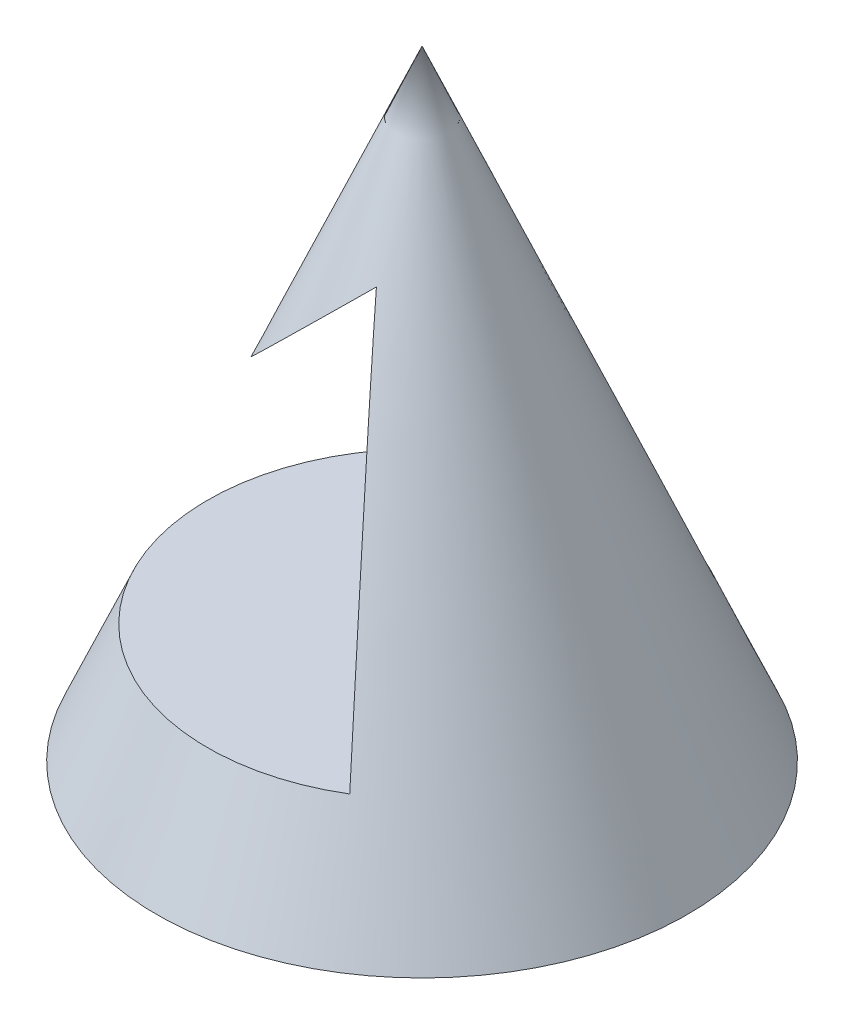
ISO-10303-21;
HEADER;
FILE_DESCRIPTION(('STEP AP214'),'2;1');
FILE_NAME('part.step','',(''),(''),'','','');
FILE_SCHEMA(('AUTOMOTIVE_DESIGN { 1 0 10303 214 1 1 1 1 }'));
ENDSEC;
DATA;
#1=APPLICATION_CONTEXT('core data for automotive mechanical design processes');
#2=APPLICATION_PROTOCOL_DEFINITION('international standard','automotive_design',2000,#1);
#3=PRODUCT_CONTEXT('',#1,'mechanical');
#4=PRODUCT('Part','Part','',(#3));
#5=PRODUCT_RELATED_PRODUCT_CATEGORY('part','',(#4));
#6=PRODUCT_DEFINITION_FORMATION('','',#4);
#7=PRODUCT_DEFINITION_CONTEXT('part definition',#1,'design');
#8=PRODUCT_DEFINITION('design','',#6,#7);
#9=PRODUCT_DEFINITION_SHAPE('','',#8);
#10=(LENGTH_UNIT() NAMED_UNIT(*) SI_UNIT(.MILLI.,.METRE.));
#11=(NAMED_UNIT(*) PLANE_ANGLE_UNIT() SI_UNIT($,.RADIAN.));
#12=(NAMED_UNIT(*) SI_UNIT($,.STERADIAN.) SOLID_ANGLE_UNIT());
#13=UNCERTAINTY_MEASURE_WITH_UNIT(LENGTH_MEASURE(1.E-05),#10,'distance_accuracy_value','');
#14=(GEOMETRIC_REPRESENTATION_CONTEXT(3) GLOBAL_UNCERTAINTY_ASSIGNED_CONTEXT((#13)) GLOBAL_UNIT_ASSIGNED_CONTEXT((#10,
#11,#12)) REPRESENTATION_CONTEXT('',''));
#15=CARTESIAN_POINT('',(0.,0.,0.));
#16=DIRECTION('',(0.,0.,1.));
#17=DIRECTION('',(1.,0.,0.));
#18=AXIS2_PLACEMENT_3D('',#15,#16,#17);
#19=CARTESIAN_POINT('',(0.,0.,0.));
#20=DIRECTION('',(0.,-1.,0.));
#21=DIRECTION('',(0.,0.,-1.));
#22=AXIS2_PLACEMENT_3D('',#19,#20,#21);
#23=PLANE('',#22);
#24=CARTESIAN_POINT('',(0.,0.,0.));
#25=DIRECTION('',(0.,-1.,0.));
#26=DIRECTION('',(0.,0.,-1.));
#27=AXIS2_PLACEMENT_3D('',#24,#25,#26);
#28=CIRCLE('',#27,30.);
#29=CARTESIAN_POINT('',(0.,0.,-30.));
#30=VERTEX_POINT('',#29);
#31=EDGE_CURVE('E76',#30,#30,#28,.T.);
#32=ORIENTED_EDGE('',*,*,#31,.T.);
#33=EDGE_LOOP('',(#32));
#34=FACE_BOUND('',#33,.T.);
#35=ADVANCED_FACE('F43',(#34),#23,.T.);
#36=CARTESIAN_POINT('',(0.,0.,0.));
#37=DIRECTION('',(0.,-1.,0.));
#38=DIRECTION('',(0.,0.,-1.));
#39=AXIS2_PLACEMENT_3D('',#36,#37,#38);
#40=CONICAL_SURFACE('',#39,30.,0.404891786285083);
#41=CARTESIAN_POINT('',(-4.5966851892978,44.5253184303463,0.));
#42=DIRECTION('',(-0.700802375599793,0.713355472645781,0.));
#43=DIRECTION('',(-0.713355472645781,-0.700802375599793,0.));
#44=AXIS2_PLACEMENT_3D('',#41,#42,#43);
#45=ELLIPSE('',#44,15.3047408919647,9.9028839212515);
#46=CARTESIAN_POINT('',(2.42403092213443,51.4224892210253,7.58381034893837));
#47=VERTEX_POINT('',#46);
#48=CARTESIAN_POINT('',(2.42403092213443,51.4224892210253,-7.58381034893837));
#49=VERTEX_POINT('',#48);
#50=EDGE_CURVE('E11',#47,#49,#45,.F.);
#51=ORIENTED_EDGE('',*,*,#50,.F.);
#52=CARTESIAN_POINT('',(12.557979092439,13.4407902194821,20.7330254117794));
#53=CARTESIAN_POINT('',(12.2029958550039,14.7712555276,20.2813906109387));
#54=CARTESIAN_POINT('',(11.8480380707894,16.1016254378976,19.8294544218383));
#55=CARTESIAN_POINT('',(11.1381883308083,18.762118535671,18.924802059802));
#56=CARTESIAN_POINT('',(10.7832963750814,20.0922417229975,18.4720858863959));
#57=CARTESIAN_POINT('',(10.0735856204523,22.752213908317,17.5656866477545));
#58=CARTESIAN_POINT('',(9.71876682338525,24.0820628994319,17.1120035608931));
#59=CARTESIAN_POINT('',(9.00923241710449,26.7413741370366,16.2034260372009));
#60=CARTESIAN_POINT('',(8.65451680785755,28.0708363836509,15.7485316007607));
#61=CARTESIAN_POINT('',(7.94524469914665,30.7291645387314,14.8372149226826));
#62=CARTESIAN_POINT('',(7.59068818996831,32.0580304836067,14.3807927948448));
#63=CARTESIAN_POINT('',(6.88175187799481,34.7151000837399,13.4658884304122));
#64=CARTESIAN_POINT('',(6.52737207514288,36.0433037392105,13.0074061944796));
#65=CARTESIAN_POINT('',(5.81885748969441,38.6987927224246,12.0876400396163));
#66=CARTESIAN_POINT('',(5.46472270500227,40.0260780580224,11.6263561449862));
#67=CARTESIAN_POINT('',(4.75679622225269,42.6793628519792,10.6998458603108));
#68=CARTESIAN_POINT('',(4.40300452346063,44.0053623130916,10.2346194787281));
#69=CARTESIAN_POINT('',(3.91381522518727,45.8388274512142,9.58680505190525));
#70=CARTESIAN_POINT('',(3.77819674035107,46.3471209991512,9.40672688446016));
#71=CARTESIAN_POINT('',(3.50705178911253,47.363363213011,9.04553141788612));
#72=CARTESIAN_POINT('',(3.3715253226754,47.8713118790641,8.8644141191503));
#73=CARTESIAN_POINT('',(3.1005806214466,48.886803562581,8.5009429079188));
#74=CARTESIAN_POINT('',(2.96516238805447,49.3943465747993,8.31858897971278));
#75=CARTESIAN_POINT('',(2.69446159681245,50.4089240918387,7.95236774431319));
#76=CARTESIAN_POINT('',(2.55917903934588,50.9159585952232,7.76850043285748));
#77=CARTESIAN_POINT('',(2.42397755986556,51.4226892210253,7.58373741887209));
#78=B_SPLINE_CURVE_WITH_KNOTS('',3,(#52,#53,#54,#55,#56,#57,#58,#59,#60,#61,#62,#63,#64,#65,#66,
#67,#68,#69,#70,#71,#72,#73,#74,#75,#76,#77),.UNSPECIFIED.,.F.,.F.,(4,2,2,2,2,2,2,2,2,2,2,2,4),
(0.,4.34754256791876,8.69508775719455,13.0427312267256,17.390373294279,21.7376984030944,
26.0850221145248,30.4323081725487,34.779584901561,36.4477104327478,38.1158353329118,
39.7839814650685,41.4521322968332),.UNSPECIFIED.);
#79=CARTESIAN_POINT('',(12.5579257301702,13.4409902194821,20.7329575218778));
#80=VERTEX_POINT('',#79);
#81=EDGE_CURVE('E75',#80,#47,#78,.T.);
#82=ORIENTED_EDGE('',*,*,#81,.F.);
#83=CARTESIAN_POINT('',(0.,13.4409902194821,0.));
#84=DIRECTION('',(0.,-1.,0.));
#85=DIRECTION('',(0.,0.,-1.));
#86=AXIS2_PLACEMENT_3D('',#83,#84,#85);
#87=CIRCLE('',#86,24.239575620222);
#88=CARTESIAN_POINT('',(12.5579257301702,13.4409902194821,-20.7329575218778));
#89=VERTEX_POINT('',#88);
#90=EDGE_CURVE('E69',#89,#80,#87,.F.);
#91=ORIENTED_EDGE('',*,*,#90,.F.);
#92=CARTESIAN_POINT('',(2.42397755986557,51.4226892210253,-7.58373741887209));
#93=CARTESIAN_POINT('',(2.53971575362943,50.9889063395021,-7.74190857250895));
#94=CARTESIAN_POINT('',(2.6555140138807,50.5548983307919,-7.89941641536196));
#95=CARTESIAN_POINT('',(2.88721294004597,49.6864985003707,-8.2132921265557));
#96=CARTESIAN_POINT('',(3.00311360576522,49.2521066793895,-8.36965999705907));
#97=CARTESIAN_POINT('',(3.35094152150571,47.948459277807,-8.83733215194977));
#98=CARTESIAN_POINT('',(3.58299644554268,47.0787251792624,-9.14720737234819));
#99=CARTESIAN_POINT('',(4.04734947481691,45.338345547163,-9.76414849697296));
#100=CARTESIAN_POINT('',(4.27964757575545,44.4677000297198,-10.0712144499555));
#101=CARTESIAN_POINT('',(4.74443120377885,42.7257065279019,-10.6832101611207));
#102=CARTESIAN_POINT('',(4.97691673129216,41.8543585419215,-10.9881399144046));
#103=CARTESIAN_POINT('',(5.51511272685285,39.8372179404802,-11.6919032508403));
#104=CARTESIAN_POINT('',(5.82087560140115,38.6912289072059,-12.0901335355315));
#105=CARTESIAN_POINT('',(6.43258509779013,36.3985621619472,-12.8844655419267));
#106=CARTESIAN_POINT('',(6.73853171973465,35.2518844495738,-13.2805672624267));
#107=CARTESIAN_POINT('',(7.65657938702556,31.8110724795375,-14.466464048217));
#108=CARTESIAN_POINT('',(8.26888724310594,29.5161631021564,-15.2538494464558));
#109=CARTESIAN_POINT('',(9.49386820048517,24.9249754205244,-16.8246926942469));
#110=CARTESIAN_POINT('',(10.1065413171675,22.6286970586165,-17.6081503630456));
#111=CARTESIAN_POINT('',(11.0257189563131,19.1836499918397,-18.7813293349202));
#112=CARTESIAN_POINT('',(11.3321384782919,18.035199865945,-19.1720531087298));
#113=CARTESIAN_POINT('',(11.9450252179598,15.7381208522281,-19.952936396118));
#114=CARTESIAN_POINT('',(12.2514924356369,14.5894919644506,-20.3430959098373));
#115=CARTESIAN_POINT('',(12.557979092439,13.4407902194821,-20.7330254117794));
#116=B_SPLINE_CURVE_WITH_KNOTS('',3,(#92,#93,#94,#95,#96,#97,#98,#99,#100,#101,#102,#103,#104,
#105,#106,#107,#108,#109,#110,#111,#112,#113,#114,#115),.UNSPECIFIED.,.F.,.F.,(4,2,2,2,2,2,2,2,
2,2,2,4),(0.,1.42801435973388,2.85602600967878,5.71202765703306,8.56797964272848,
11.4239381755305,15.1773767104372,18.9308173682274,26.4377108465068,33.9449466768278,
37.6985396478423,41.4521316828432),.UNSPECIFIED.);
#117=EDGE_CURVE('E51',#49,#89,#116,.T.);
#118=ORIENTED_EDGE('',*,*,#117,.F.);
#119=EDGE_LOOP('',(#51,#82,#91,#118));
#120=FACE_BOUND('',#119,.T.);
#121=CARTESIAN_POINT('',(0.,70.,0.));
#122=VERTEX_POINT('',#121);
#123=VERTEX_LOOP('',#122);
#124=FACE_BOUND('',#123,.T.);
#125=ORIENTED_EDGE('',*,*,#31,.F.);
#126=EDGE_LOOP('',(#125));
#127=FACE_BOUND('',#126,.T.);
#128=ADVANCED_FACE('F86',(#120,#124,#127),#40,.T.);
#129=CARTESIAN_POINT('',(2.42403092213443,51.4224892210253,-30.));
#130=DIRECTION('',(-0.700802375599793,0.713355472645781,0.));
#131=DIRECTION('',(-0.713355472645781,-0.700802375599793,0.));
#132=AXIS2_PLACEMENT_3D('',#129,#130,#131);
#133=PLANE('',#132);
#134=ORIENTED_EDGE('',*,*,#50,.T.);
#135=DIRECTION('',(0.,0.,1.));
#136=VECTOR('',#135,1.);
#137=CARTESIAN_POINT('',(2.42403092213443,51.4224892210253,-30.));
#138=LINE('',#137,#136);
#139=EDGE_CURVE('E83',#49,#47,#138,.T.);
#140=ORIENTED_EDGE('',*,*,#139,.T.);
#141=EDGE_LOOP('',(#134,#140));
#142=FACE_BOUND('',#141,.T.);
#143=ADVANCED_FACE('F105',(#142),#133,.F.);
#144=CARTESIAN_POINT('',(12.5579257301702,13.4409902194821,-30.));
#145=DIRECTION('',(0.966200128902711,0.257793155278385,0.));
#146=DIRECTION('',(-0.257793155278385,0.966200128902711,0.));
#147=AXIS2_PLACEMENT_3D('',#144,#145,#146);
#148=PLANE('',#147);
#149=ORIENTED_EDGE('',*,*,#117,.T.);
#150=DIRECTION('',(0.,0.,1.));
#151=VECTOR('',#150,1.);
#152=CARTESIAN_POINT('',(12.5579257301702,13.4409902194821,-30.));
#153=LINE('',#152,#151);
#154=EDGE_CURVE('E57',#89,#80,#153,.T.);
#155=ORIENTED_EDGE('',*,*,#154,.T.);
#156=ORIENTED_EDGE('',*,*,#81,.T.);
#157=ORIENTED_EDGE('',*,*,#139,.F.);
#158=EDGE_LOOP('',(#149,#155,#156,#157));
#159=FACE_BOUND('',#158,.T.);
#160=ADVANCED_FACE('F79',(#159),#148,.F.);
#161=CARTESIAN_POINT('',(-36.23781029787,13.4409902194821,-30.));
#162=DIRECTION('',(0.,-1.,0.));
#163=DIRECTION('',(0.,0.,-1.));
#164=AXIS2_PLACEMENT_3D('',#161,#162,#163);
#165=PLANE('',#164);
#166=ORIENTED_EDGE('',*,*,#90,.T.);
#167=ORIENTED_EDGE('',*,*,#154,.F.);
#168=EDGE_LOOP('',(#166,#167));
#169=FACE_BOUND('',#168,.T.);
#170=ADVANCED_FACE('F70',(#169),#165,.F.);
#171=CLOSED_SHELL('',(#35,#128,#143,#160,#170));
#172=MANIFOLD_SOLID_BREP('B2',#171);
#173=ADVANCED_BREP_SHAPE_REPRESENTATION('',(#18,#172),#14);
#174=SHAPE_DEFINITION_REPRESENTATION(#9,#173);
ENDSEC;
END-ISO-10303-21;
